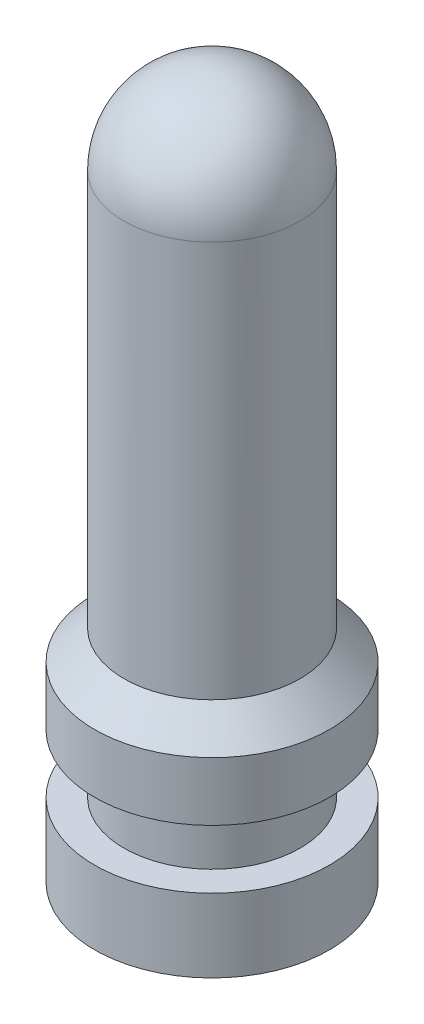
from build123d import *


with BuildPart() as part:
    # Esquisse1 → Base-R_volution (revolve)
    with BuildSketch(Plane.XY, mode=Mode.PRIVATE) as base_r_volution_sk:
        with BuildLine():
            Line((4, 4.5), (3, 4.5))
            Line((3, 4.5), (3, 2.5))
            Line((3, 2.5), (4, 2.5))
            Line((4, 2.5), (4, 0))
            Line((4, 0), (3.5, 0))
            ThreePointArc((3.5, 0), (3.199433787, 1.249946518), (2.363453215, 2.226595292))
            ThreePointArc((2.363453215, 2.226595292), (1.342336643, 3.161391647), (0, 3.5))
            Line((0, 3.5), (0, 24))
            ThreePointArc((0, 24), (2.121320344, 23.121320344), (3, 21))
            Line((3, 21), (3, 7.5))
            Line((3, 7.5), (4, 6.5))
            Line((4, 6.5), (4, 4.5))
        make_face()
    revolve(base_r_volution_sk.sketch.rotate(Axis((0, 0, 0), (0, 1, 0)), 90), axis=Axis((0, 0, 0), (0, 1, 0)))


solid = part.part
